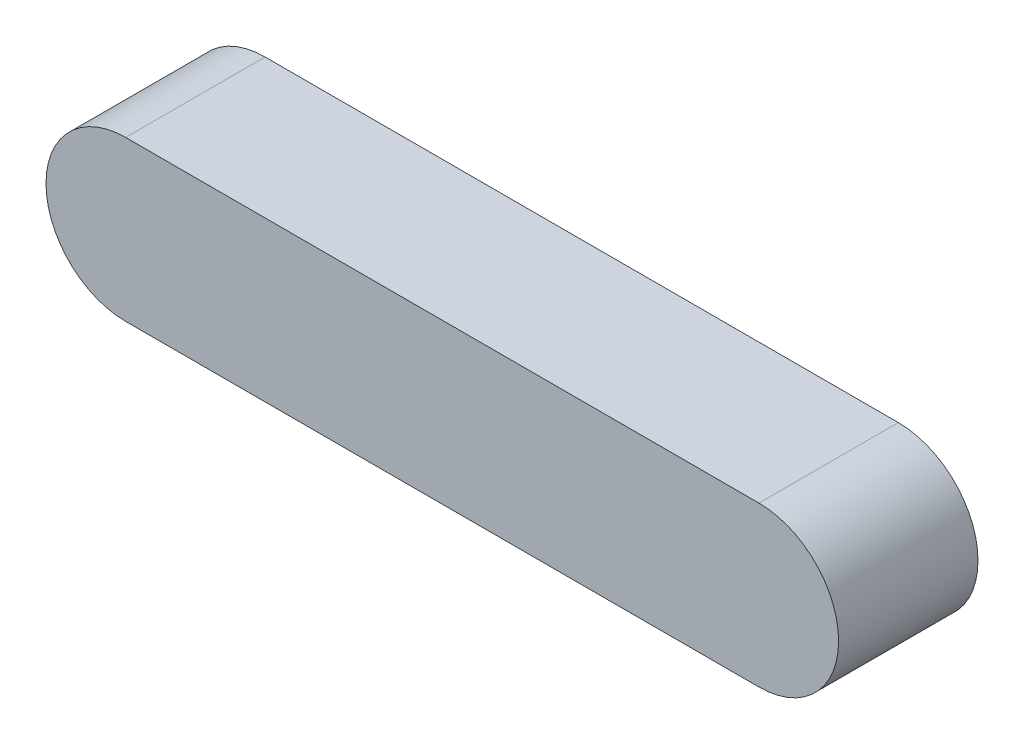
from build123d import *

# Parameters (mm, degrees)
EXTRUSION1_DEPTH = 7


with BuildPart() as part:
    # Esquisse1 → Extrusion1 (new body)
    with BuildSketch(Plane.XY):
        with BuildLine():
            Line((15.9, 4), (-15.9, 4))
            ThreePointArc((-15.9, 4), (-19.9, 0), (-15.9, -4))
            Line((-15.9, -4), (15.9, -4))
            ThreePointArc((15.9, -4), (19.9, 0), (15.9, 4))
        make_face()
    extrude(amount=EXTRUSION1_DEPTH)


solid = part.part
